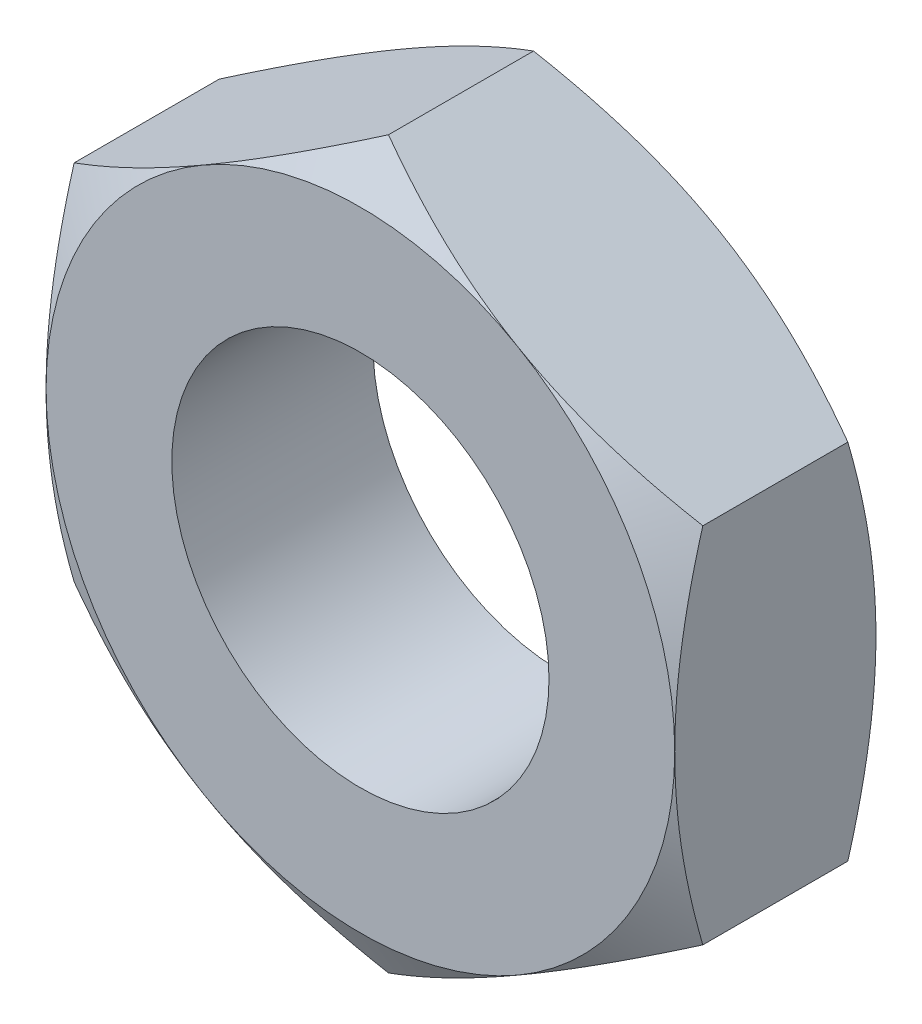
from build123d import *

# Parameters (mm, degrees)
BASE_EXTRUSION_DEPTH    = 3.2
ESQUISSE3_R             = 3
ENL_V_MAT_EXTRU_1_DEPTH = 9.280901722


with BuildPart() as part:
    # Esquisse1 → Base-Extrusion (new body)
    with BuildSketch(Plane.XY):
        Polygon((5, -2.886751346), (5, 2.886751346), (0, 5.773502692), (-5, 2.886751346), (-5, -2.886751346), (0, -5.773502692), align=None)
    extrude(amount=-BASE_EXTRUSION_DEPTH)

    # Esquisse2 → Enl_vement de mati_re-R_volution1 (revolve, cut)
    with BuildSketch(Plane(origin=(0, 0, 0), x_dir=(1, 0, 0), z_dir=(0, 1, 0)), mode=Mode.PRIVATE) as enl_vement_de_mati_re_r_volution1_sk:
        Polygon((-5, 0), (-8.771281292, 0), (-8.771281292, 3.2), (-5, 3.2), (-7.771281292, 1.6), align=None)
    revolve(enl_vement_de_mati_re_r_volution1_sk.sketch.rotate(Axis((0, 0, -3.2), (0, 0, 1)), 180), axis=Axis((0, 0, -3.2), (0, 0, 1)), mode=Mode.SUBTRACT)

    # Esquisse3 → Enl_v. mat.-Extru.1 (cut, through all)
    with BuildSketch(Plane.XY):
        Circle(ESQUISSE3_R)
    extrude(amount=-ENL_V_MAT_EXTRU_1_DEPTH, mode=Mode.SUBTRACT)


solid = part.part
